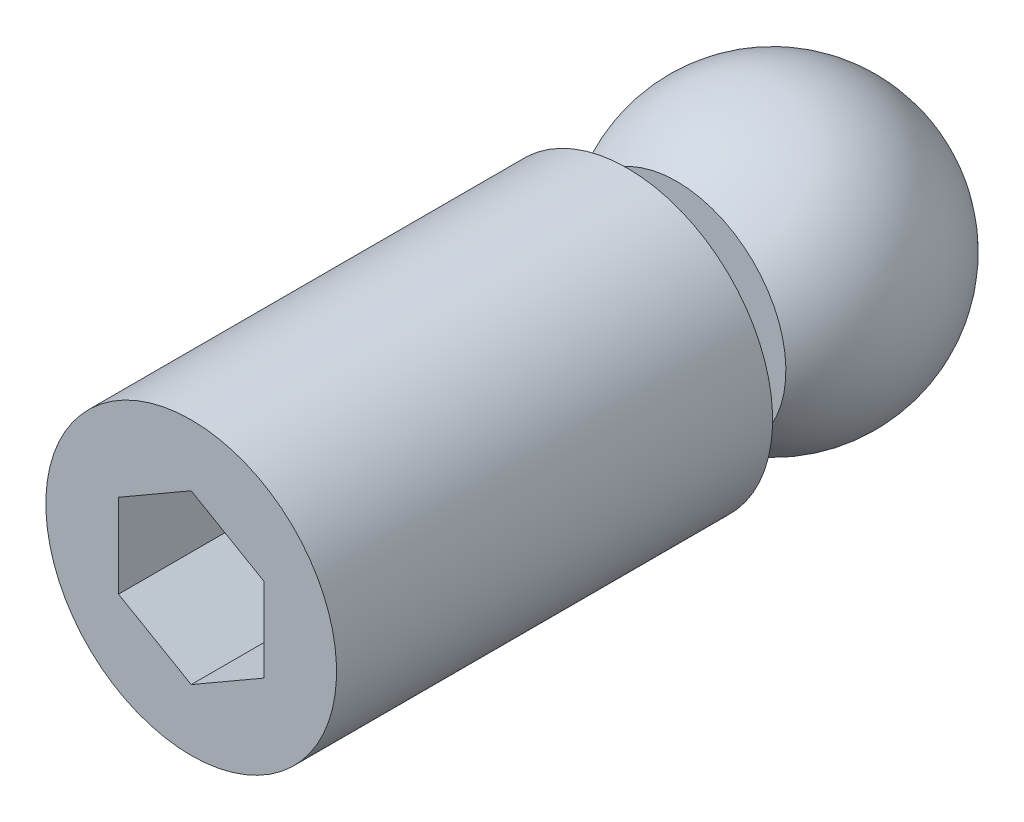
ISO-10303-21;
HEADER;
FILE_DESCRIPTION(('STEP AP214'),'2;1');
FILE_NAME('part.step','',(''),(''),'','','');
FILE_SCHEMA(('AUTOMOTIVE_DESIGN { 1 0 10303 214 1 1 1 1 }'));
ENDSEC;
DATA;
#1=APPLICATION_CONTEXT('core data for automotive mechanical design processes');
#2=APPLICATION_PROTOCOL_DEFINITION('international standard','automotive_design',2000,#1);
#3=PRODUCT_CONTEXT('',#1,'mechanical');
#4=PRODUCT('Part','Part','',(#3));
#5=PRODUCT_RELATED_PRODUCT_CATEGORY('part','',(#4));
#6=PRODUCT_DEFINITION_FORMATION('','',#4);
#7=PRODUCT_DEFINITION_CONTEXT('part definition',#1,'design');
#8=PRODUCT_DEFINITION('design','',#6,#7);
#9=PRODUCT_DEFINITION_SHAPE('','',#8);
#10=(LENGTH_UNIT() NAMED_UNIT(*) SI_UNIT(.MILLI.,.METRE.));
#11=(NAMED_UNIT(*) PLANE_ANGLE_UNIT() SI_UNIT($,.RADIAN.));
#12=(NAMED_UNIT(*) SI_UNIT($,.STERADIAN.) SOLID_ANGLE_UNIT());
#13=UNCERTAINTY_MEASURE_WITH_UNIT(LENGTH_MEASURE(1.E-05),#10,'distance_accuracy_value','');
#14=(GEOMETRIC_REPRESENTATION_CONTEXT(3) GLOBAL_UNCERTAINTY_ASSIGNED_CONTEXT((#13)) GLOBAL_UNIT_ASSIGNED_CONTEXT((#10,
#11,#12)) REPRESENTATION_CONTEXT('',''));
#15=CARTESIAN_POINT('',(0.,0.,0.));
#16=DIRECTION('',(0.,0.,1.));
#17=DIRECTION('',(1.,0.,0.));
#18=AXIS2_PLACEMENT_3D('',#15,#16,#17);
#19=CARTESIAN_POINT('',(0.,0.,5.));
#20=DIRECTION('',(0.,-1.,0.));
#21=DIRECTION('',(-1.,0.,0.));
#22=AXIS2_PLACEMENT_3D('',#19,#20,#21);
#23=SPHERICAL_SURFACE('',#22,5.);
#24=CARTESIAN_POINT('',(0.,0.,5.));
#25=DIRECTION('',(0.,0.,1.));
#26=DIRECTION('',(0.,1.,0.));
#27=AXIS2_PLACEMENT_3D('',#24,#25,#26);
#28=SPHERICAL_SURFACE('',#27,5.);
#29=CARTESIAN_POINT('',(0.,0.,8.3));
#30=DIRECTION('',(0.,0.,1.));
#31=DIRECTION('',(0.,1.,0.));
#32=AXIS2_PLACEMENT_3D('',#29,#30,#31);
#33=CIRCLE('',#32,3.75632799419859);
#34=CARTESIAN_POINT('',(0.,3.75632799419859,8.3));
#35=VERTEX_POINT('',#34);
#36=EDGE_CURVE('E9',#35,#35,#33,.T.);
#37=ORIENTED_EDGE('',*,*,#36,.F.);
#38=EDGE_LOOP('',(#37));
#39=FACE_BOUND('',#38,.T.);
#40=ADVANCED_FACE('F14',(#39),#28,.T.);
#41=CARTESIAN_POINT('',(0.,-3.75632799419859,8.3));
#42=DIRECTION('',(0.,0.,-1.));
#43=DIRECTION('',(0.,-1.,0.));
#44=AXIS2_PLACEMENT_3D('',#41,#42,#43);
#45=PLANE('',#44);
#46=CARTESIAN_POINT('',(0.,0.,8.3));
#47=DIRECTION('',(0.,0.,1.));
#48=DIRECTION('',(0.,1.,0.));
#49=AXIS2_PLACEMENT_3D('',#46,#47,#48);
#50=CIRCLE('',#49,2.5);
#51=CARTESIAN_POINT('',(0.,2.5,8.3));
#52=VERTEX_POINT('',#51);
#53=EDGE_CURVE('E21',#52,#52,#50,.T.);
#54=ORIENTED_EDGE('',*,*,#53,.F.);
#55=EDGE_LOOP('',(#54));
#56=FACE_BOUND('',#55,.T.);
#57=ORIENTED_EDGE('',*,*,#36,.T.);
#58=EDGE_LOOP('',(#57));
#59=FACE_BOUND('',#58,.T.);
#60=ADVANCED_FACE('F134',(#56,#59),#45,.F.);
#61=CARTESIAN_POINT('',(0.,0.,8.3));
#62=DIRECTION('',(0.,0.,1.));
#63=DIRECTION('',(0.,1.,0.));
#64=AXIS2_PLACEMENT_3D('',#61,#62,#63);
#65=CYLINDRICAL_SURFACE('',#64,2.5);
#66=ORIENTED_EDGE('',*,*,#53,.T.);
#67=EDGE_LOOP('',(#66));
#68=FACE_BOUND('',#67,.T.);
#69=CARTESIAN_POINT('',(0.,0.,10.));
#70=DIRECTION('',(0.,0.,1.));
#71=DIRECTION('',(0.,1.,0.));
#72=AXIS2_PLACEMENT_3D('',#69,#70,#71);
#73=CIRCLE('',#72,2.5);
#74=CARTESIAN_POINT('',(0.,2.5,10.));
#75=VERTEX_POINT('',#74);
#76=EDGE_CURVE('E126',#75,#75,#73,.T.);
#77=ORIENTED_EDGE('',*,*,#76,.F.);
#78=EDGE_LOOP('',(#77));
#79=FACE_BOUND('',#78,.T.);
#80=ADVANCED_FACE('F131',(#68,#79),#65,.T.);
#81=CARTESIAN_POINT('',(0.,-5.,10.));
#82=DIRECTION('',(0.,0.,-1.));
#83=DIRECTION('',(0.,-1.,0.));
#84=AXIS2_PLACEMENT_3D('',#81,#82,#83);
#85=PLANE('',#84);
#86=ORIENTED_EDGE('',*,*,#76,.T.);
#87=EDGE_LOOP('',(#86));
#88=FACE_BOUND('',#87,.T.);
#89=CARTESIAN_POINT('',(0.,0.,10.));
#90=DIRECTION('',(0.,0.,1.));
#91=DIRECTION('',(0.,1.,0.));
#92=AXIS2_PLACEMENT_3D('',#89,#90,#91);
#93=CIRCLE('',#92,5.);
#94=CARTESIAN_POINT('',(0.,5.,10.));
#95=VERTEX_POINT('',#94);
#96=EDGE_CURVE('E123',#95,#95,#93,.T.);
#97=ORIENTED_EDGE('',*,*,#96,.F.);
#98=EDGE_LOOP('',(#97));
#99=FACE_BOUND('',#98,.T.);
#100=ADVANCED_FACE('F157',(#88,#99),#85,.T.);
#101=CARTESIAN_POINT('',(0.,0.,8.3));
#102=DIRECTION('',(0.,0.,1.));
#103=DIRECTION('',(0.,1.,0.));
#104=AXIS2_PLACEMENT_3D('',#101,#102,#103);
#105=CYLINDRICAL_SURFACE('',#104,5.);
#106=ORIENTED_EDGE('',*,*,#96,.T.);
#107=EDGE_LOOP('',(#106));
#108=FACE_BOUND('',#107,.T.);
#109=CARTESIAN_POINT('',(0.,0.,25.));
#110=DIRECTION('',(0.,0.,1.));
#111=DIRECTION('',(0.,1.,0.));
#112=AXIS2_PLACEMENT_3D('',#109,#110,#111);
#113=CIRCLE('',#112,5.);
#114=CARTESIAN_POINT('',(0.,5.,25.));
#115=VERTEX_POINT('',#114);
#116=EDGE_CURVE('E115',#115,#115,#113,.T.);
#117=ORIENTED_EDGE('',*,*,#116,.F.);
#118=EDGE_LOOP('',(#117));
#119=FACE_BOUND('',#118,.T.);
#120=ADVANCED_FACE('F165',(#108,#119),#105,.T.);
#121=CARTESIAN_POINT('',(0.,0.,25.));
#122=DIRECTION('',(0.,0.,1.));
#123=DIRECTION('',(0.,1.,0.));
#124=AXIS2_PLACEMENT_3D('',#121,#122,#123);
#125=PLANE('',#124);
#126=DIRECTION('',(-0.866025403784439,0.5,0.));
#127=VECTOR('',#126,1.);
#128=CARTESIAN_POINT('',(2.5,1.44337567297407,25.));
#129=LINE('',#128,#127);
#130=CARTESIAN_POINT('',(2.5,1.44337567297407,25.));
#131=VERTEX_POINT('',#130);
#132=CARTESIAN_POINT('',(0.,2.88675134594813,25.));
#133=VERTEX_POINT('',#132);
#134=EDGE_CURVE('E28',#131,#133,#129,.T.);
#135=ORIENTED_EDGE('',*,*,#134,.F.);
#136=DIRECTION('',(0.,1.,0.));
#137=VECTOR('',#136,1.);
#138=CARTESIAN_POINT('',(2.5,-1.44337567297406,25.));
#139=LINE('',#138,#137);
#140=CARTESIAN_POINT('',(2.5,-1.44337567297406,25.));
#141=VERTEX_POINT('',#140);
#142=EDGE_CURVE('E111',#141,#131,#139,.T.);
#143=ORIENTED_EDGE('',*,*,#142,.F.);
#144=DIRECTION('',(0.866025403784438,0.5,0.));
#145=VECTOR('',#144,1.);
#146=CARTESIAN_POINT('',(0.,-2.88675134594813,25.));
#147=LINE('',#146,#145);
#148=CARTESIAN_POINT('',(0.,-2.88675134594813,25.));
#149=VERTEX_POINT('',#148);
#150=EDGE_CURVE('E109',#149,#141,#147,.T.);
#151=ORIENTED_EDGE('',*,*,#150,.F.);
#152=DIRECTION('',(0.866025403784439,-0.5,0.));
#153=VECTOR('',#152,1.);
#154=CARTESIAN_POINT('',(-2.5,-1.44337567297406,25.));
#155=LINE('',#154,#153);
#156=CARTESIAN_POINT('',(-2.5,-1.44337567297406,25.));
#157=VERTEX_POINT('',#156);
#158=EDGE_CURVE('E76',#157,#149,#155,.T.);
#159=ORIENTED_EDGE('',*,*,#158,.F.);
#160=DIRECTION('',(0.,-1.,0.));
#161=VECTOR('',#160,1.);
#162=CARTESIAN_POINT('',(-2.5,1.44337567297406,25.));
#163=LINE('',#162,#161);
#164=CARTESIAN_POINT('',(-2.5,1.44337567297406,25.));
#165=VERTEX_POINT('',#164);
#166=EDGE_CURVE('E105',#165,#157,#163,.T.);
#167=ORIENTED_EDGE('',*,*,#166,.F.);
#168=DIRECTION('',(-0.866025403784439,-0.5,0.));
#169=VECTOR('',#168,1.);
#170=CARTESIAN_POINT('',(0.,2.88675134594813,25.));
#171=LINE('',#170,#169);
#172=EDGE_CURVE('E102',#133,#165,#171,.T.);
#173=ORIENTED_EDGE('',*,*,#172,.F.);
#174=EDGE_LOOP('',(#135,#143,#151,#159,#167,#173));
#175=FACE_BOUND('',#174,.T.);
#176=ORIENTED_EDGE('',*,*,#116,.T.);
#177=EDGE_LOOP('',(#176));
#178=FACE_BOUND('',#177,.T.);
#179=ADVANCED_FACE('F174',(#175,#178),#125,.T.);
#180=CARTESIAN_POINT('',(2.5,1.44337567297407,19.));
#181=DIRECTION('',(0.5,0.866025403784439,0.));
#182=DIRECTION('',(-0.866025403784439,0.5,0.));
#183=AXIS2_PLACEMENT_3D('',#180,#181,#182);
#184=PLANE('',#183);
#185=ORIENTED_EDGE('',*,*,#134,.T.);
#186=DIRECTION('',(0.,0.,1.));
#187=VECTOR('',#186,1.);
#188=CARTESIAN_POINT('',(0.,2.88675134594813,19.));
#189=LINE('',#188,#187);
#190=CARTESIAN_POINT('',(0.,2.88675134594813,19.));
#191=VERTEX_POINT('',#190);
#192=EDGE_CURVE('E58',#191,#133,#189,.T.);
#193=ORIENTED_EDGE('',*,*,#192,.F.);
#194=DIRECTION('',(-0.866025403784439,0.5,0.));
#195=VECTOR('',#194,1.);
#196=CARTESIAN_POINT('',(2.5,1.44337567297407,19.));
#197=LINE('',#196,#195);
#198=CARTESIAN_POINT('',(2.5,1.44337567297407,19.));
#199=VERTEX_POINT('',#198);
#200=EDGE_CURVE('E113',#199,#191,#197,.T.);
#201=ORIENTED_EDGE('',*,*,#200,.F.);
#202=DIRECTION('',(0.,0.,1.));
#203=VECTOR('',#202,1.);
#204=CARTESIAN_POINT('',(2.5,1.44337567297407,19.));
#205=LINE('',#204,#203);
#206=EDGE_CURVE('E36',#199,#131,#205,.T.);
#207=ORIENTED_EDGE('',*,*,#206,.T.);
#208=EDGE_LOOP('',(#185,#193,#201,#207));
#209=FACE_BOUND('',#208,.T.);
#210=ADVANCED_FACE('F183',(#209),#184,.F.);
#211=CARTESIAN_POINT('',(2.5,-1.44337567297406,19.));
#212=DIRECTION('',(1.,0.,0.));
#213=DIRECTION('',(0.,0.,-1.));
#214=AXIS2_PLACEMENT_3D('',#211,#212,#213);
#215=PLANE('',#214);
#216=ORIENTED_EDGE('',*,*,#142,.T.);
#217=ORIENTED_EDGE('',*,*,#206,.F.);
#218=DIRECTION('',(0.,1.,0.));
#219=VECTOR('',#218,1.);
#220=CARTESIAN_POINT('',(2.5,-1.44337567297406,19.));
#221=LINE('',#220,#219);
#222=CARTESIAN_POINT('',(2.5,-1.44337567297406,19.));
#223=VERTEX_POINT('',#222);
#224=EDGE_CURVE('E88',#223,#199,#221,.T.);
#225=ORIENTED_EDGE('',*,*,#224,.F.);
#226=DIRECTION('',(0.,0.,1.));
#227=VECTOR('',#226,1.);
#228=CARTESIAN_POINT('',(2.5,-1.44337567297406,19.));
#229=LINE('',#228,#227);
#230=EDGE_CURVE('E80',#223,#141,#229,.T.);
#231=ORIENTED_EDGE('',*,*,#230,.T.);
#232=EDGE_LOOP('',(#216,#217,#225,#231));
#233=FACE_BOUND('',#232,.T.);
#234=ADVANCED_FACE('F192',(#233),#215,.F.);
#235=CARTESIAN_POINT('',(0.,-2.88675134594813,19.));
#236=DIRECTION('',(0.5,-0.866025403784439,0.));
#237=DIRECTION('',(0.866025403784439,0.5,0.));
#238=AXIS2_PLACEMENT_3D('',#235,#236,#237);
#239=PLANE('',#238);
#240=ORIENTED_EDGE('',*,*,#150,.T.);
#241=ORIENTED_EDGE('',*,*,#230,.F.);
#242=DIRECTION('',(0.866025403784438,0.5,0.));
#243=VECTOR('',#242,1.);
#244=CARTESIAN_POINT('',(0.,-2.88675134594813,19.));
#245=LINE('',#244,#243);
#246=CARTESIAN_POINT('',(0.,-2.88675134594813,19.));
#247=VERTEX_POINT('',#246);
#248=EDGE_CURVE('E84',#247,#223,#245,.T.);
#249=ORIENTED_EDGE('',*,*,#248,.F.);
#250=DIRECTION('',(0.,0.,1.));
#251=VECTOR('',#250,1.);
#252=CARTESIAN_POINT('',(0.,-2.88675134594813,19.));
#253=LINE('',#252,#251);
#254=EDGE_CURVE('E69',#247,#149,#253,.T.);
#255=ORIENTED_EDGE('',*,*,#254,.T.);
#256=EDGE_LOOP('',(#240,#241,#249,#255));
#257=FACE_BOUND('',#256,.T.);
#258=ADVANCED_FACE('F85',(#257),#239,.F.);
#259=CARTESIAN_POINT('',(-2.5,-1.44337567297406,19.));
#260=DIRECTION('',(-0.5,-0.866025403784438,0.));
#261=DIRECTION('',(0.866025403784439,-0.5,0.));
#262=AXIS2_PLACEMENT_3D('',#259,#260,#261);
#263=PLANE('',#262);
#264=ORIENTED_EDGE('',*,*,#158,.T.);
#265=ORIENTED_EDGE('',*,*,#254,.F.);
#266=DIRECTION('',(0.866025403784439,-0.5,0.));
#267=VECTOR('',#266,1.);
#268=CARTESIAN_POINT('',(-2.5,-1.44337567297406,19.));
#269=LINE('',#268,#267);
#270=CARTESIAN_POINT('',(-2.5,-1.44337567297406,19.));
#271=VERTEX_POINT('',#270);
#272=EDGE_CURVE('E73',#271,#247,#269,.T.);
#273=ORIENTED_EDGE('',*,*,#272,.F.);
#274=DIRECTION('',(0.,0.,1.));
#275=VECTOR('',#274,1.);
#276=CARTESIAN_POINT('',(-2.5,-1.44337567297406,19.));
#277=LINE('',#276,#275);
#278=EDGE_CURVE('E81',#271,#157,#277,.T.);
#279=ORIENTED_EDGE('',*,*,#278,.T.);
#280=EDGE_LOOP('',(#264,#265,#273,#279));
#281=FACE_BOUND('',#280,.T.);
#282=ADVANCED_FACE('F71',(#281),#263,.F.);
#283=CARTESIAN_POINT('',(-2.5,1.44337567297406,19.));
#284=DIRECTION('',(-1.,0.,0.));
#285=DIRECTION('',(0.,-1.,0.));
#286=AXIS2_PLACEMENT_3D('',#283,#284,#285);
#287=PLANE('',#286);
#288=ORIENTED_EDGE('',*,*,#166,.T.);
#289=ORIENTED_EDGE('',*,*,#278,.F.);
#290=DIRECTION('',(0.,-1.,0.));
#291=VECTOR('',#290,1.);
#292=CARTESIAN_POINT('',(-2.5,1.44337567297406,19.));
#293=LINE('',#292,#291);
#294=CARTESIAN_POINT('',(-2.5,1.44337567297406,19.));
#295=VERTEX_POINT('',#294);
#296=EDGE_CURVE('E94',#295,#271,#293,.T.);
#297=ORIENTED_EDGE('',*,*,#296,.F.);
#298=DIRECTION('',(0.,0.,1.));
#299=VECTOR('',#298,1.);
#300=CARTESIAN_POINT('',(-2.5,1.44337567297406,19.));
#301=LINE('',#300,#299);
#302=EDGE_CURVE('E118',#295,#165,#301,.T.);
#303=ORIENTED_EDGE('',*,*,#302,.T.);
#304=EDGE_LOOP('',(#288,#289,#297,#303));
#305=FACE_BOUND('',#304,.T.);
#306=ADVANCED_FACE('F214',(#305),#287,.F.);
#307=CARTESIAN_POINT('',(0.,2.88675134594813,19.));
#308=DIRECTION('',(-0.5,0.866025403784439,0.));
#309=DIRECTION('',(-0.866025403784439,-0.5,0.));
#310=AXIS2_PLACEMENT_3D('',#307,#308,#309);
#311=PLANE('',#310);
#312=ORIENTED_EDGE('',*,*,#172,.T.);
#313=ORIENTED_EDGE('',*,*,#302,.F.);
#314=DIRECTION('',(-0.866025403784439,-0.5,0.));
#315=VECTOR('',#314,1.);
#316=CARTESIAN_POINT('',(0.,2.88675134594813,19.));
#317=LINE('',#316,#315);
#318=EDGE_CURVE('E96',#191,#295,#317,.T.);
#319=ORIENTED_EDGE('',*,*,#318,.F.);
#320=ORIENTED_EDGE('',*,*,#192,.T.);
#321=EDGE_LOOP('',(#312,#313,#319,#320));
#322=FACE_BOUND('',#321,.T.);
#323=ADVANCED_FACE('F222',(#322),#311,.F.);
#324=CARTESIAN_POINT('',(0.,2.88675134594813,19.));
#325=DIRECTION('',(0.,0.,1.));
#326=DIRECTION('',(1.,0.,0.));
#327=AXIS2_PLACEMENT_3D('',#324,#325,#326);
#328=PLANE('',#327);
#329=ORIENTED_EDGE('',*,*,#200,.T.);
#330=ORIENTED_EDGE('',*,*,#318,.T.);
#331=ORIENTED_EDGE('',*,*,#296,.T.);
#332=ORIENTED_EDGE('',*,*,#272,.T.);
#333=ORIENTED_EDGE('',*,*,#248,.T.);
#334=ORIENTED_EDGE('',*,*,#224,.T.);
#335=EDGE_LOOP('',(#329,#330,#331,#332,#333,#334));
#336=FACE_BOUND('',#335,.T.);
#337=ADVANCED_FACE('F91',(#336),#328,.T.);
#338=CLOSED_SHELL('',(#40,#60,#80,#100,#120,#179,#210,#234,#258,#282,#306,#323,#337));
#339=MANIFOLD_SOLID_BREP('B1',#338);
#340=ADVANCED_BREP_SHAPE_REPRESENTATION('',(#18,#339),#14);
#341=SHAPE_DEFINITION_REPRESENTATION(#9,#340);
ENDSEC;
END-ISO-10303-21;
